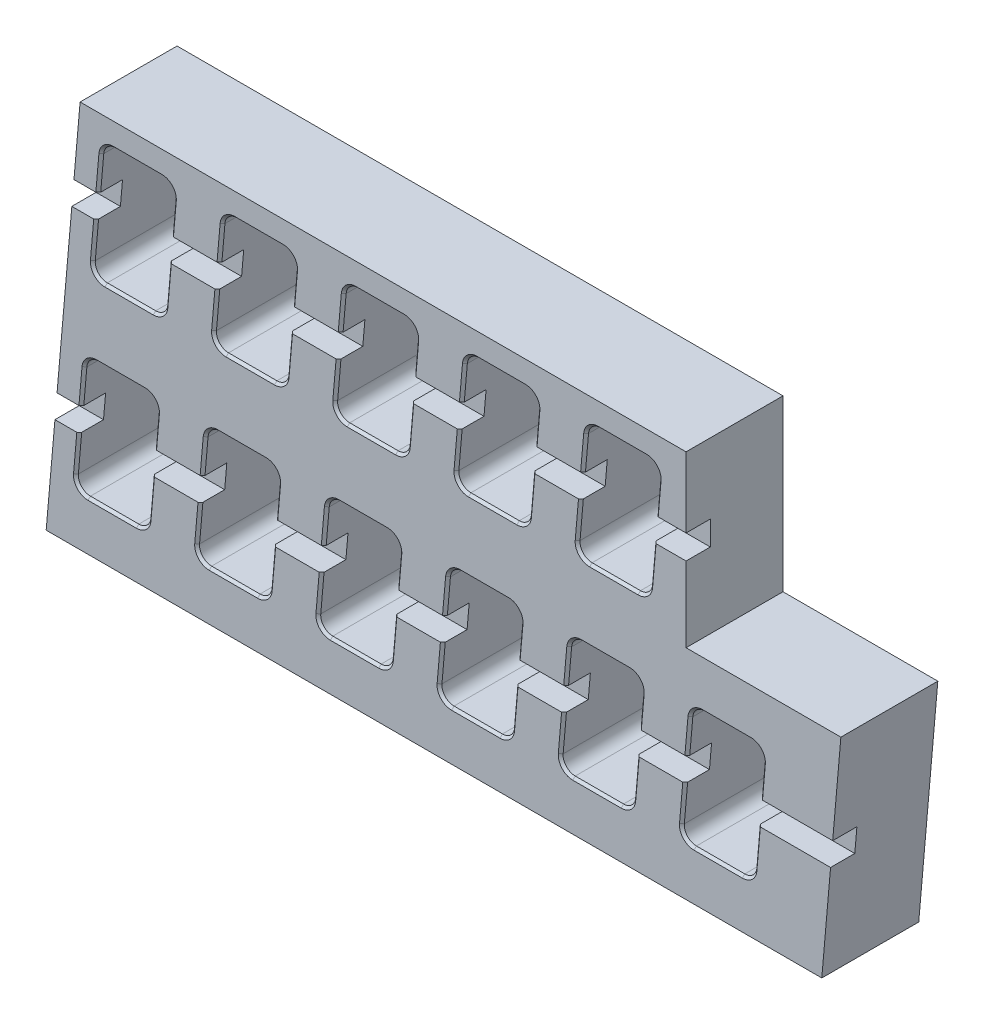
from build123d import *

# Parameters (mm, degrees)
EXTRUDE1_DEPTH             = 20
CUT_EXTRUDE1_DEPTH         = 20
CHAMFER1_SIZE              = 0.5
LPATTERN2_COUNT            = 6
LPATTERN2_PITCH            = 25
LPATTERN2_COUNT_DIR2       = 2
LPATTERN2_PITCH_DIR2       = 40
CHAMFER1_OF_LPATTERN2_SIZE = 0.5
CUT_EXTRUDE2_DEPTH         = 5
SKETCH7_W                  = 40.988168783
SKETCH7_H                  = 43.465740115
CUT_EXTRUDE6_DEPTH         = 187.249019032


with BuildPart() as part:
    # Sketch1 → Extrude1 (new body)
    with BuildSketch(Plane.XY):
        Polygon((0, 0), (160, 0), (166.999093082, 80), (6.999093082, 80), align=None)
    extrude(amount=EXTRUDE1_DEPTH)

    # Sketch2 → Cut-Extrude1 (cut)
    with BuildSketch(Plane.XY.offset(20)):
        with BuildLine():
            Line((11.381090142, 72.717889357), (9.631316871, 52.717889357))
            ThreePointArc((9.631316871, 52.717889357), (10.278610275, 50.811024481), (12.121803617, 50))
            Line((12.121803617, 50), (22.102704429, 50))
            ThreePointArc((22.102704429, 50), (23.791679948, 50.656806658), (24.593191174, 52.282110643))
            Line((24.593191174, 52.282110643), (26.342964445, 72.282110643))
            ThreePointArc((26.342964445, 72.282110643), (25.695671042, 74.188975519), (23.852477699, 75))
            Line((23.852477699, 75), (13.871576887, 75))
            ThreePointArc((13.871576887, 75), (12.182601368, 74.343193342), (11.381090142, 72.717889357))
        make_face()
    cut_extrude1 = extrude(amount=-CUT_EXTRUDE1_DEPTH, mode=Mode.SUBTRACT)

    # Chamfer1
    chamfer1_edges = [part.edges().sort_by_distance(p)[0] for p in [
        (12.182601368, 74.343193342, 20),
        (10.506203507, 62.717889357, 20),
        (10.278610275, 50.811024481, 20),
        (17.112254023, 50, 20),
        (23.791679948, 50.656806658, 20),
        (25.468077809, 62.282110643, 20),
        (25.695671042, 74.188975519, 20),
        (18.862027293, 75, 20),
    ]]
    chamfer(chamfer1_edges, length=CHAMFER1_SIZE)

    # LPattern2: Cut-Extrude1 6 × 2
    with Locations(*[Vector(1, 0, 0) * (i * LPATTERN2_PITCH) + Vector(-0.08715574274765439, -0.9961946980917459, 0) * (j * LPATTERN2_PITCH_DIR2) for i in range(LPATTERN2_COUNT) for j in range(LPATTERN2_COUNT_DIR2) if (i, j) != (0, 0)]):
        add(cut_extrude1, mode=Mode.SUBTRACT)

    # Chamfer1 of LPattern2
    chamfer1_of_lpattern2_edges = [part.edges().sort_by_distance(p)[0] for p in [
        (8.696371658, 34.495405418, 20),
        (7.019973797, 22.870101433, 20),
        (6.792380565, 10.963236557, 20),
        (13.626024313, 10.152212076, 20),
        (20.305450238, 10.809018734, 20),
        (21.9818481, 22.434322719, 20),
        (22.209441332, 34.341187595, 20),
        (15.375797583, 35.152212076, 20),
        (37.182601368, 74.343193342, 20),
        (35.506203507, 62.717889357, 20),
        (35.278610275, 50.811024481, 20),
        (42.112254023, 50, 20),
        (48.791679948, 50.656806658, 20),
        (50.468077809, 62.282110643, 20),
        (50.695671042, 74.188975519, 20),
        (43.862027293, 75, 20),
        (33.696371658, 34.495405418, 20),
        (32.019973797, 22.870101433, 20),
        (31.792380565, 10.963236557, 20),
        (38.626024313, 10.152212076, 20),
        (45.305450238, 10.809018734, 20),
        (46.9818481, 22.434322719, 20),
        (47.209441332, 34.341187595, 20),
        (40.375797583, 35.152212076, 20),
        (62.182601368, 74.343193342, 20),
        (60.506203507, 62.717889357, 20),
        (60.278610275, 50.811024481, 20),
        (67.112254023, 50, 20),
        (73.791679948, 50.656806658, 20),
        (75.468077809, 62.282110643, 20),
        (75.695671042, 74.188975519, 20),
        (68.862027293, 75, 20),
        (58.696371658, 34.495405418, 20),
        (57.019973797, 22.870101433, 20),
        (56.792380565, 10.963236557, 20),
        (63.626024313, 10.152212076, 20),
        (70.305450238, 10.809018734, 20),
        (71.9818481, 22.434322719, 20),
        (72.209441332, 34.341187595, 20),
        (65.375797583, 35.152212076, 20),
        (87.182601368, 74.343193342, 20),
        (85.506203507, 62.717889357, 20),
        (85.278610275, 50.811024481, 20),
        (92.112254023, 50, 20),
        (98.791679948, 50.656806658, 20),
        (100.468077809, 62.282110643, 20),
        (100.695671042, 74.188975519, 20),
        (93.862027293, 75, 20),
        (83.696371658, 34.495405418, 20),
        (82.019973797, 22.870101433, 20),
        (81.792380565, 10.963236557, 20),
        (88.626024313, 10.152212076, 20),
        (95.305450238, 10.809018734, 20),
        (96.9818481, 22.434322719, 20),
        (97.209441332, 34.341187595, 20),
        (90.375797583, 35.152212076, 20),
        (112.182601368, 74.343193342, 20),
        (110.506203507, 62.717889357, 20),
        (110.278610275, 50.811024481, 20),
        (117.112254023, 50, 20),
        (123.791679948, 50.656806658, 20),
        (125.468077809, 62.282110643, 20),
        (125.695671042, 74.188975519, 20),
        (118.862027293, 75, 20),
        (108.696371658, 34.495405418, 20),
        (107.019973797, 22.870101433, 20),
        (106.792380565, 10.963236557, 20),
        (113.626024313, 10.152212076, 20),
        (120.305450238, 10.809018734, 20),
        (121.9818481, 22.434322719, 20),
        (122.209441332, 34.341187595, 20),
        (115.375797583, 35.152212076, 20),
        (137.182601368, 74.343193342, 20),
        (135.506203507, 62.717889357, 20),
        (135.278610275, 50.811024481, 20),
        (142.112254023, 50, 20),
        (148.791679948, 50.656806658, 20),
        (150.468077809, 62.282110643, 20),
        (150.695671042, 74.188975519, 20),
        (143.862027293, 75, 20),
        (133.696371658, 34.495405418, 20),
        (132.019973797, 22.870101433, 20),
        (131.792380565, 10.963236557, 20),
        (138.626024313, 10.152212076, 20),
        (145.305450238, 10.809018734, 20),
        (146.9818481, 22.434322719, 20),
        (147.209441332, 34.341187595, 20),
        (140.375797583, 35.152212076, 20),
    ]]
    chamfer(chamfer1_of_lpattern2_edges, length=CHAMFER1_OF_LPATTERN2_SIZE)

    # Sketch3 → Cut-Extrude2 (cut)
    with BuildSketch(Plane.XY.offset(20)):
        Polygon((3.285424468, 60.5), (167.300703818, 60.5), (167.738147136, 65.5), (3.722867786, 65.5), align=None)
        Polygon((-0.200805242, 20.652212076), (163.814474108, 20.652212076), (164.251917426, 25.652212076), (0.236638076, 25.652212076), align=None)
    extrude(amount=-CUT_EXTRUDE2_DEPTH, mode=Mode.SUBTRACT)

    # Sketch7 → Cut-Extrude6 (cut, through all)
    with BuildSketch(Plane.XY.offset(20)):
        with Locations((152.493177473, 66.732870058)):
            Rectangle(SKETCH7_W, SKETCH7_H)
    extrude(amount=-CUT_EXTRUDE6_DEPTH, mode=Mode.SUBTRACT)


solid = part.part
